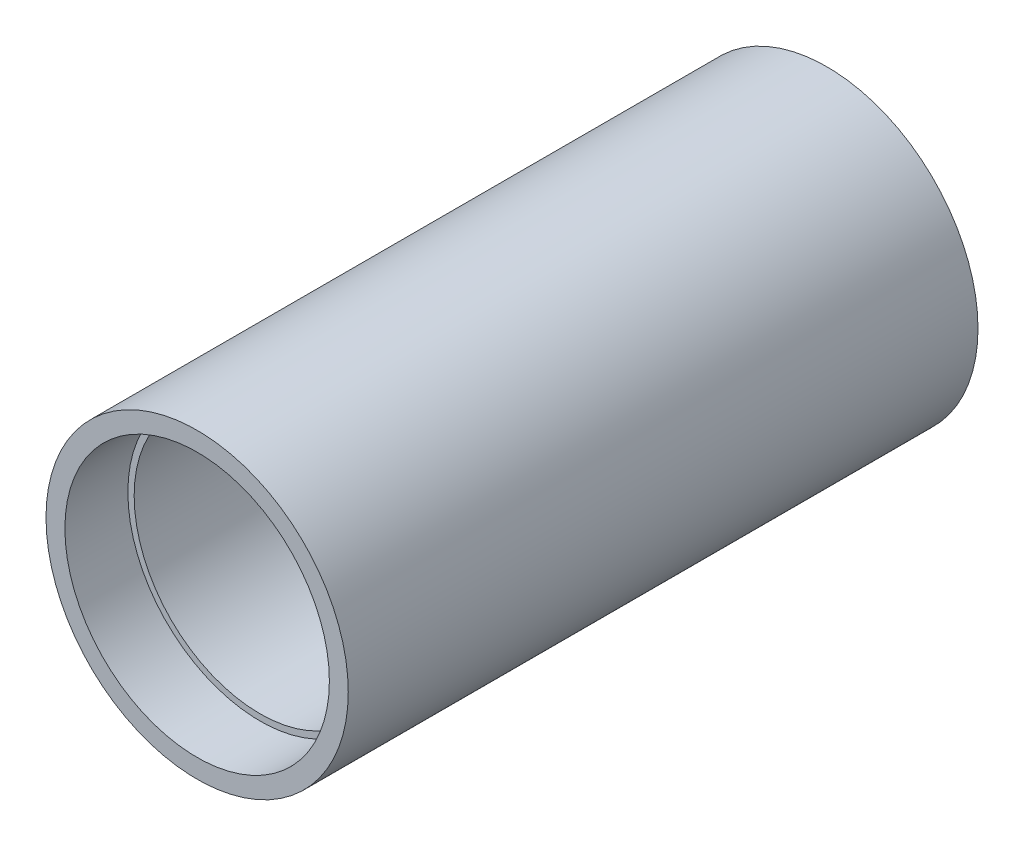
ISO-10303-21;
HEADER;
FILE_DESCRIPTION(('STEP AP214'),'2;1');
FILE_NAME('part.step','',(''),(''),'','','');
FILE_SCHEMA(('AUTOMOTIVE_DESIGN { 1 0 10303 214 1 1 1 1 }'));
ENDSEC;
DATA;
#1=APPLICATION_CONTEXT('core data for automotive mechanical design processes');
#2=APPLICATION_PROTOCOL_DEFINITION('international standard','automotive_design',2000,#1);
#3=PRODUCT_CONTEXT('',#1,'mechanical');
#4=PRODUCT('Part','Part','',(#3));
#5=PRODUCT_RELATED_PRODUCT_CATEGORY('part','',(#4));
#6=PRODUCT_DEFINITION_FORMATION('','',#4);
#7=PRODUCT_DEFINITION_CONTEXT('part definition',#1,'design');
#8=PRODUCT_DEFINITION('design','',#6,#7);
#9=PRODUCT_DEFINITION_SHAPE('','',#8);
#10=(LENGTH_UNIT() NAMED_UNIT(*) SI_UNIT(.MILLI.,.METRE.));
#11=(NAMED_UNIT(*) PLANE_ANGLE_UNIT() SI_UNIT($,.RADIAN.));
#12=(NAMED_UNIT(*) SI_UNIT($,.STERADIAN.) SOLID_ANGLE_UNIT());
#13=UNCERTAINTY_MEASURE_WITH_UNIT(LENGTH_MEASURE(1.E-05),#10,'distance_accuracy_value','');
#14=(GEOMETRIC_REPRESENTATION_CONTEXT(3) GLOBAL_UNCERTAINTY_ASSIGNED_CONTEXT((#13)) GLOBAL_UNIT_ASSIGNED_CONTEXT((#10,
#11,#12)) REPRESENTATION_CONTEXT('',''));
#15=CARTESIAN_POINT('',(0.,0.,0.));
#16=DIRECTION('',(0.,0.,1.));
#17=DIRECTION('',(1.,0.,0.));
#18=AXIS2_PLACEMENT_3D('',#15,#16,#17);
#19=CARTESIAN_POINT('',(0.,0.,16.));
#20=DIRECTION('',(0.,0.,1.));
#21=DIRECTION('',(1.,0.,0.));
#22=AXIS2_PLACEMENT_3D('',#19,#20,#21);
#23=CYLINDRICAL_SURFACE('',#22,20.);
#24=CARTESIAN_POINT('',(0.,0.,16.));
#25=DIRECTION('',(0.,0.,1.));
#26=DIRECTION('',(1.,0.,0.));
#27=AXIS2_PLACEMENT_3D('',#24,#25,#26);
#28=CIRCLE('',#27,20.);
#29=CARTESIAN_POINT('',(20.,0.,16.));
#30=VERTEX_POINT('',#29);
#31=EDGE_CURVE('E53',#30,#30,#28,.T.);
#32=ORIENTED_EDGE('',*,*,#31,.F.);
#33=EDGE_LOOP('',(#32));
#34=FACE_BOUND('',#33,.T.);
#35=CARTESIAN_POINT('',(0.,0.,40.));
#36=DIRECTION('',(0.,0.,1.));
#37=DIRECTION('',(1.,0.,0.));
#38=AXIS2_PLACEMENT_3D('',#35,#36,#37);
#39=CIRCLE('',#38,20.);
#40=CARTESIAN_POINT('',(20.,0.,40.));
#41=VERTEX_POINT('',#40);
#42=EDGE_CURVE('E69',#41,#41,#39,.T.);
#43=ORIENTED_EDGE('',*,*,#42,.T.);
#44=EDGE_LOOP('',(#43));
#45=FACE_BOUND('',#44,.T.);
#46=ADVANCED_FACE('F32',(#34,#45),#23,.F.);
#47=CARTESIAN_POINT('',(0.,0.,82.001));
#48=DIRECTION('',(0.,0.,-1.));
#49=DIRECTION('',(-1.,0.,0.));
#50=AXIS2_PLACEMENT_3D('',#47,#48,#49);
#51=CYLINDRICAL_SURFACE('',#50,16.);
#52=CARTESIAN_POINT('',(0.,0.,-39.));
#53=DIRECTION('',(0.,0.,-1.));
#54=DIRECTION('',(-1.,0.,0.));
#55=AXIS2_PLACEMENT_3D('',#52,#53,#54);
#56=CIRCLE('',#55,16.);
#57=CARTESIAN_POINT('',(-16.,0.,-39.));
#58=VERTEX_POINT('',#57);
#59=EDGE_CURVE('E48',#58,#58,#56,.T.);
#60=ORIENTED_EDGE('',*,*,#59,.T.);
#61=EDGE_LOOP('',(#60));
#62=FACE_BOUND('',#61,.T.);
#63=CARTESIAN_POINT('',(0.,0.,2.));
#64=DIRECTION('',(0.,0.,1.));
#65=DIRECTION('',(1.,0.,0.));
#66=AXIS2_PLACEMENT_3D('',#63,#64,#65);
#67=CIRCLE('',#66,16.);
#68=CARTESIAN_POINT('',(16.,0.,2.));
#69=VERTEX_POINT('',#68);
#70=EDGE_CURVE('E60',#69,#69,#67,.T.);
#71=ORIENTED_EDGE('',*,*,#70,.T.);
#72=EDGE_LOOP('',(#71));
#73=FACE_BOUND('',#72,.T.);
#74=ADVANCED_FACE('F99',(#62,#73),#51,.F.);
#75=CARTESIAN_POINT('',(0.,0.,50.));
#76=DIRECTION('',(0.,0.,-1.));
#77=DIRECTION('',(-1.,0.,0.));
#78=AXIS2_PLACEMENT_3D('',#75,#76,#77);
#79=CYLINDRICAL_SURFACE('',#78,24.);
#80=CARTESIAN_POINT('',(0.,0.,50.));
#81=DIRECTION('',(0.,0.,1.));
#82=DIRECTION('',(1.,0.,0.));
#83=AXIS2_PLACEMENT_3D('',#80,#81,#82);
#84=CIRCLE('',#83,24.);
#85=CARTESIAN_POINT('',(24.,0.,50.));
#86=VERTEX_POINT('',#85);
#87=EDGE_CURVE('E10',#86,#86,#84,.T.);
#88=ORIENTED_EDGE('',*,*,#87,.F.);
#89=EDGE_LOOP('',(#88));
#90=FACE_BOUND('',#89,.T.);
#91=CARTESIAN_POINT('',(0.,0.,-50.));
#92=DIRECTION('',(0.,0.,1.));
#93=DIRECTION('',(1.,0.,0.));
#94=AXIS2_PLACEMENT_3D('',#91,#92,#93);
#95=CIRCLE('',#94,24.);
#96=CARTESIAN_POINT('',(24.,0.,-50.));
#97=VERTEX_POINT('',#96);
#98=EDGE_CURVE('E36',#97,#97,#95,.T.);
#99=ORIENTED_EDGE('',*,*,#98,.T.);
#100=EDGE_LOOP('',(#99));
#101=FACE_BOUND('',#100,.T.);
#102=ADVANCED_FACE('F34',(#90,#101),#79,.T.);
#103=CARTESIAN_POINT('',(0.,0.,50.));
#104=DIRECTION('',(0.,0.,1.));
#105=DIRECTION('',(1.,0.,0.));
#106=AXIS2_PLACEMENT_3D('',#103,#104,#105);
#107=PLANE('',#106);
#108=CARTESIAN_POINT('',(0.,0.,50.));
#109=DIRECTION('',(0.,0.,1.));
#110=DIRECTION('',(1.,0.,0.));
#111=AXIS2_PLACEMENT_3D('',#108,#109,#110);
#112=CIRCLE('',#111,21.);
#113=CARTESIAN_POINT('',(21.,0.,50.));
#114=VERTEX_POINT('',#113);
#115=EDGE_CURVE('E66',#114,#114,#112,.T.);
#116=ORIENTED_EDGE('',*,*,#115,.F.);
#117=EDGE_LOOP('',(#116));
#118=FACE_BOUND('',#117,.T.);
#119=ORIENTED_EDGE('',*,*,#87,.T.);
#120=EDGE_LOOP('',(#119));
#121=FACE_BOUND('',#120,.T.);
#122=ADVANCED_FACE('F89',(#118,#121),#107,.T.);
#123=CARTESIAN_POINT('',(0.,0.,-50.));
#124=DIRECTION('',(0.,0.,1.));
#125=DIRECTION('',(1.,0.,0.));
#126=AXIS2_PLACEMENT_3D('',#123,#124,#125);
#127=PLANE('',#126);
#128=CARTESIAN_POINT('',(0.,0.,-50.));
#129=DIRECTION('',(0.,0.,-1.));
#130=DIRECTION('',(-1.,0.,0.));
#131=AXIS2_PLACEMENT_3D('',#128,#129,#130);
#132=CIRCLE('',#131,21.);
#133=CARTESIAN_POINT('',(-21.,0.,-50.));
#134=VERTEX_POINT('',#133);
#135=EDGE_CURVE('E45',#134,#134,#132,.T.);
#136=ORIENTED_EDGE('',*,*,#135,.F.);
#137=EDGE_LOOP('',(#136));
#138=FACE_BOUND('',#137,.T.);
#139=ORIENTED_EDGE('',*,*,#98,.F.);
#140=EDGE_LOOP('',(#139));
#141=FACE_BOUND('',#140,.T.);
#142=ADVANCED_FACE('F91',(#138,#141),#127,.F.);
#143=CARTESIAN_POINT('',(0.,0.,-39.));
#144=DIRECTION('',(0.,0.,-1.));
#145=DIRECTION('',(-1.,0.,0.));
#146=AXIS2_PLACEMENT_3D('',#143,#144,#145);
#147=CYLINDRICAL_SURFACE('',#146,21.);
#148=CARTESIAN_POINT('',(0.,0.,-39.));
#149=DIRECTION('',(0.,0.,-1.));
#150=DIRECTION('',(-1.,0.,0.));
#151=AXIS2_PLACEMENT_3D('',#148,#149,#150);
#152=CIRCLE('',#151,21.);
#153=CARTESIAN_POINT('',(-21.,0.,-39.));
#154=VERTEX_POINT('',#153);
#155=EDGE_CURVE('E43',#154,#154,#152,.T.);
#156=ORIENTED_EDGE('',*,*,#155,.F.);
#157=EDGE_LOOP('',(#156));
#158=FACE_BOUND('',#157,.T.);
#159=ORIENTED_EDGE('',*,*,#135,.T.);
#160=EDGE_LOOP('',(#159));
#161=FACE_BOUND('',#160,.T.);
#162=ADVANCED_FACE('F97',(#158,#161),#147,.F.);
#163=CARTESIAN_POINT('',(0.,0.,-39.));
#164=DIRECTION('',(0.,0.,-1.));
#165=DIRECTION('',(-1.,0.,0.));
#166=AXIS2_PLACEMENT_3D('',#163,#164,#165);
#167=PLANE('',#166);
#168=ORIENTED_EDGE('',*,*,#59,.F.);
#169=EDGE_LOOP('',(#168));
#170=FACE_BOUND('',#169,.T.);
#171=ORIENTED_EDGE('',*,*,#155,.T.);
#172=EDGE_LOOP('',(#171));
#173=FACE_BOUND('',#172,.T.);
#174=ADVANCED_FACE('F114',(#170,#173),#167,.T.);
#175=CARTESIAN_POINT('',(0.,0.,16.));
#176=DIRECTION('',(0.,0.,1.));
#177=DIRECTION('',(1.,0.,0.));
#178=AXIS2_PLACEMENT_3D('',#175,#176,#177);
#179=PLANE('',#178);
#180=CARTESIAN_POINT('',(0.,0.,16.));
#181=DIRECTION('',(0.,0.,1.));
#182=DIRECTION('',(1.,0.,0.));
#183=AXIS2_PLACEMENT_3D('',#180,#181,#182);
#184=CIRCLE('',#183,18.);
#185=CARTESIAN_POINT('',(18.,0.,16.));
#186=VERTEX_POINT('',#185);
#187=EDGE_CURVE('E57',#186,#186,#184,.T.);
#188=ORIENTED_EDGE('',*,*,#187,.F.);
#189=EDGE_LOOP('',(#188));
#190=FACE_BOUND('',#189,.T.);
#191=ORIENTED_EDGE('',*,*,#31,.T.);
#192=EDGE_LOOP('',(#191));
#193=FACE_BOUND('',#192,.T.);
#194=ADVANCED_FACE('F112',(#190,#193),#179,.T.);
#195=CARTESIAN_POINT('',(0.,0.,2.));
#196=DIRECTION('',(0.,0.,1.));
#197=DIRECTION('',(1.,0.,0.));
#198=AXIS2_PLACEMENT_3D('',#195,#196,#197);
#199=CYLINDRICAL_SURFACE('',#198,18.);
#200=CARTESIAN_POINT('',(0.,0.,2.));
#201=DIRECTION('',(0.,0.,1.));
#202=DIRECTION('',(1.,0.,0.));
#203=AXIS2_PLACEMENT_3D('',#200,#201,#202);
#204=CIRCLE('',#203,18.);
#205=CARTESIAN_POINT('',(18.,0.,2.));
#206=VERTEX_POINT('',#205);
#207=EDGE_CURVE('E56',#206,#206,#204,.T.);
#208=ORIENTED_EDGE('',*,*,#207,.F.);
#209=EDGE_LOOP('',(#208));
#210=FACE_BOUND('',#209,.T.);
#211=ORIENTED_EDGE('',*,*,#187,.T.);
#212=EDGE_LOOP('',(#211));
#213=FACE_BOUND('',#212,.T.);
#214=ADVANCED_FACE('F143',(#210,#213),#199,.F.);
#215=CARTESIAN_POINT('',(0.,0.,2.));
#216=DIRECTION('',(0.,0.,1.));
#217=DIRECTION('',(1.,0.,0.));
#218=AXIS2_PLACEMENT_3D('',#215,#216,#217);
#219=PLANE('',#218);
#220=ORIENTED_EDGE('',*,*,#70,.F.);
#221=EDGE_LOOP('',(#220));
#222=FACE_BOUND('',#221,.T.);
#223=ORIENTED_EDGE('',*,*,#207,.T.);
#224=EDGE_LOOP('',(#223));
#225=FACE_BOUND('',#224,.T.);
#226=ADVANCED_FACE('F85',(#222,#225),#219,.T.);
#227=CARTESIAN_POINT('',(0.,0.,40.));
#228=DIRECTION('',(0.,0.,1.));
#229=DIRECTION('',(1.,0.,0.));
#230=AXIS2_PLACEMENT_3D('',#227,#228,#229);
#231=CYLINDRICAL_SURFACE('',#230,21.);
#232=CARTESIAN_POINT('',(0.,0.,40.));
#233=DIRECTION('',(0.,0.,1.));
#234=DIRECTION('',(1.,0.,0.));
#235=AXIS2_PLACEMENT_3D('',#232,#233,#234);
#236=CIRCLE('',#235,21.);
#237=CARTESIAN_POINT('',(21.,0.,40.));
#238=VERTEX_POINT('',#237);
#239=EDGE_CURVE('E65',#238,#238,#236,.T.);
#240=ORIENTED_EDGE('',*,*,#239,.F.);
#241=EDGE_LOOP('',(#240));
#242=FACE_BOUND('',#241,.T.);
#243=ORIENTED_EDGE('',*,*,#115,.T.);
#244=EDGE_LOOP('',(#243));
#245=FACE_BOUND('',#244,.T.);
#246=ADVANCED_FACE('F79',(#242,#245),#231,.F.);
#247=CARTESIAN_POINT('',(0.,0.,40.));
#248=DIRECTION('',(0.,0.,1.));
#249=DIRECTION('',(1.,0.,0.));
#250=AXIS2_PLACEMENT_3D('',#247,#248,#249);
#251=PLANE('',#250);
#252=ORIENTED_EDGE('',*,*,#42,.F.);
#253=EDGE_LOOP('',(#252));
#254=FACE_BOUND('',#253,.T.);
#255=ORIENTED_EDGE('',*,*,#239,.T.);
#256=EDGE_LOOP('',(#255));
#257=FACE_BOUND('',#256,.T.);
#258=ADVANCED_FACE('F76',(#254,#257),#251,.T.);
#259=CLOSED_SHELL('',(#46,#74,#102,#122,#142,#162,#174,#194,#214,#226,#246,#258));
#260=MANIFOLD_SOLID_BREP('B2',#259);
#261=ADVANCED_BREP_SHAPE_REPRESENTATION('',(#18,#260),#14);
#262=SHAPE_DEFINITION_REPRESENTATION(#9,#261);
ENDSEC;
END-ISO-10303-21;
